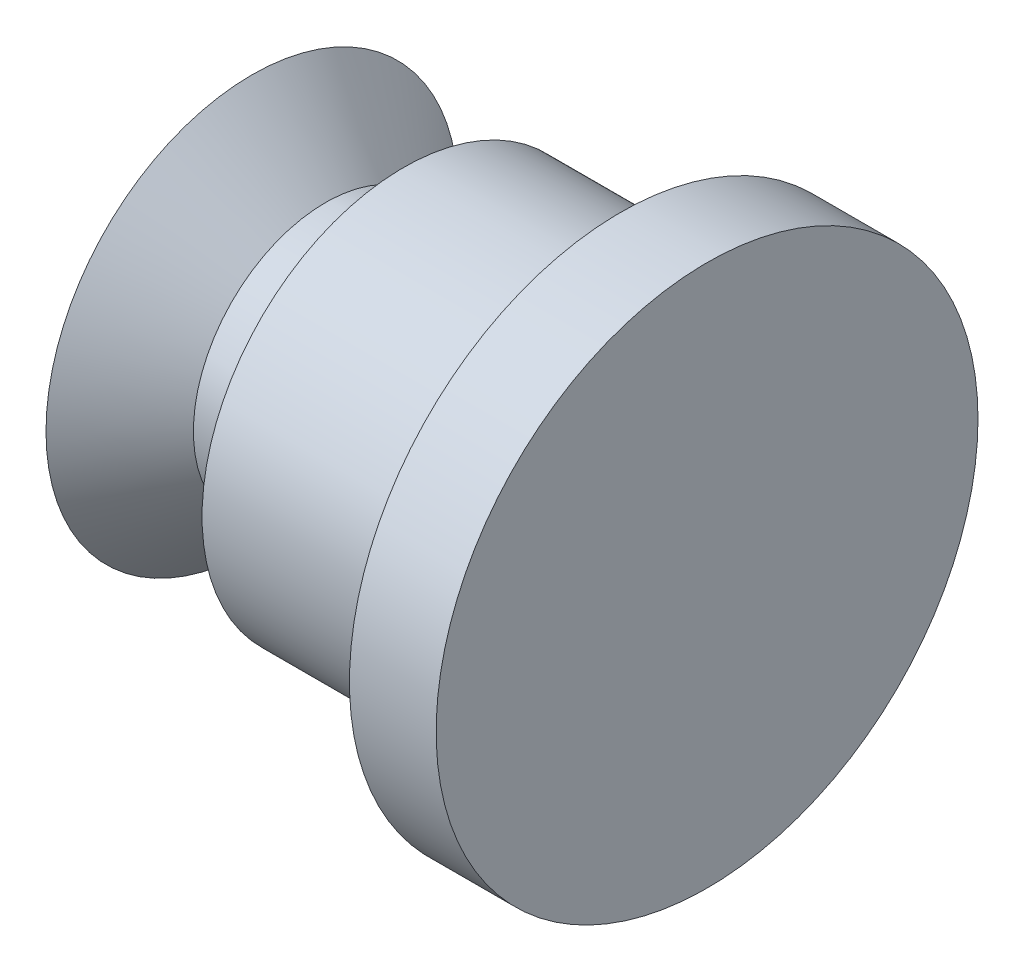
from build123d import *


with BuildPart() as part:
    # Sketch1 → Revolve1 (revolve)
    with BuildSketch(Plane.XY, mode=Mode.PRIVATE) as revolve1_sk:
        Polygon((0, 0), (0, 3.175), (-1.016, 3.175), (-1.016, 2.3622), (-3.556, 2.3622), (-3.556, 1.5494), (-4.4704, 1.5494), (-5.334, 2.413), (-5.334, 0), align=None)
    revolve(revolve1_sk.sketch.rotate(Axis((0, 0, 0), (-1, 0, 0)), 90), axis=Axis((0, 0, 0), (-1, 0, 0)))


solid = part.part
